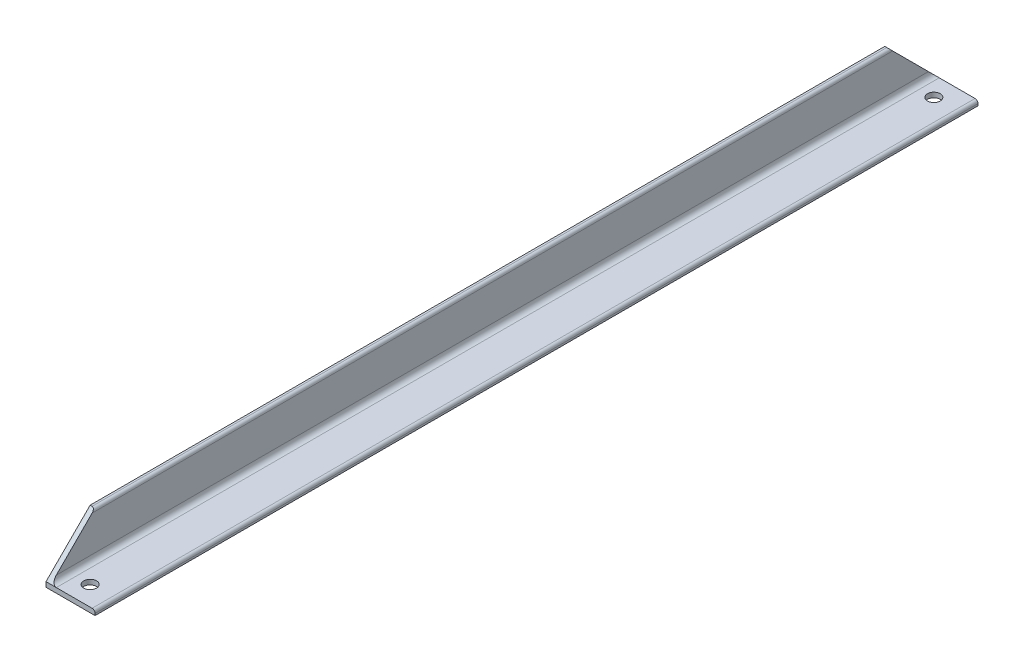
ISO-10303-21;
HEADER;
FILE_DESCRIPTION(('STEP AP214'),'2;1');
FILE_NAME('part.step','',(''),(''),'','','');
FILE_SCHEMA(('AUTOMOTIVE_DESIGN { 1 0 10303 214 1 1 1 1 }'));
ENDSEC;
DATA;
#1=APPLICATION_CONTEXT('core data for automotive mechanical design processes');
#2=APPLICATION_PROTOCOL_DEFINITION('international standard','automotive_design',2000,#1);
#3=PRODUCT_CONTEXT('',#1,'mechanical');
#4=PRODUCT('Part','Part','',(#3));
#5=PRODUCT_RELATED_PRODUCT_CATEGORY('part','',(#4));
#6=PRODUCT_DEFINITION_FORMATION('','',#4);
#7=PRODUCT_DEFINITION_CONTEXT('part definition',#1,'design');
#8=PRODUCT_DEFINITION('design','',#6,#7);
#9=PRODUCT_DEFINITION_SHAPE('','',#8);
#10=(LENGTH_UNIT() NAMED_UNIT(*) SI_UNIT(.MILLI.,.METRE.));
#11=(NAMED_UNIT(*) PLANE_ANGLE_UNIT() SI_UNIT($,.RADIAN.));
#12=(NAMED_UNIT(*) SI_UNIT($,.STERADIAN.) SOLID_ANGLE_UNIT());
#13=UNCERTAINTY_MEASURE_WITH_UNIT(LENGTH_MEASURE(1.E-05),#10,'distance_accuracy_value','');
#14=(GEOMETRIC_REPRESENTATION_CONTEXT(3) GLOBAL_UNCERTAINTY_ASSIGNED_CONTEXT((#13)) GLOBAL_UNIT_ASSIGNED_CONTEXT((#10,
#11,#12)) REPRESENTATION_CONTEXT('',''));
#15=CARTESIAN_POINT('',(0.,0.,0.));
#16=DIRECTION('',(0.,0.,1.));
#17=DIRECTION('',(1.,0.,0.));
#18=AXIS2_PLACEMENT_3D('',#15,#16,#17);
#19=CARTESIAN_POINT('',(1.99999999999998,50.,450.));
#20=DIRECTION('',(0.,-1.,0.));
#21=DIRECTION('',(0.,0.,-1.));
#22=AXIS2_PLACEMENT_3D('',#19,#20,#21);
#23=PLANE('',#22);
#24=DIRECTION('',(0.,0.,-1.));
#25=VECTOR('',#24,1.);
#26=CARTESIAN_POINT('',(1.99999999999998,50.,450.));
#27=LINE('',#26,#25);
#28=CARTESIAN_POINT('',(2.,50.,405.));
#29=VERTEX_POINT('',#28);
#30=CARTESIAN_POINT('',(2.,50.,-405.));
#31=VERTEX_POINT('',#30);
#32=EDGE_CURVE('E159',#29,#31,#27,.T.);
#33=ORIENTED_EDGE('',*,*,#32,.T.);
#34=DIRECTION('',(-1.,0.,0.));
#35=VECTOR('',#34,1.);
#36=CARTESIAN_POINT('',(920.,50.,-405.));
#37=LINE('',#36,#35);
#38=CARTESIAN_POINT('',(0.,50.,-405.));
#39=VERTEX_POINT('',#38);
#40=EDGE_CURVE('E136',#31,#39,#37,.T.);
#41=ORIENTED_EDGE('',*,*,#40,.T.);
#42=DIRECTION('',(0.,0.,-1.));
#43=VECTOR('',#42,1.);
#44=CARTESIAN_POINT('',(0.,50.,450.));
#45=LINE('',#44,#43);
#46=CARTESIAN_POINT('',(0.,50.,405.));
#47=VERTEX_POINT('',#46);
#48=EDGE_CURVE('E135',#47,#39,#45,.T.);
#49=ORIENTED_EDGE('',*,*,#48,.F.);
#50=DIRECTION('',(-1.,0.,0.));
#51=VECTOR('',#50,1.);
#52=CARTESIAN_POINT('',(920.,50.,405.));
#53=LINE('',#52,#51);
#54=EDGE_CURVE('E204',#29,#47,#53,.T.);
#55=ORIENTED_EDGE('',*,*,#54,.F.);
#56=EDGE_LOOP('',(#33,#41,#49,#55));
#57=FACE_BOUND('',#56,.T.);
#58=ADVANCED_FACE('F39',(#57),#23,.F.);
#59=CARTESIAN_POINT('',(0.,50.,450.));
#60=DIRECTION('',(1.,0.,0.));
#61=DIRECTION('',(0.,1.,0.));
#62=AXIS2_PLACEMENT_3D('',#59,#60,#61);
#63=PLANE('',#62);
#64=ORIENTED_EDGE('',*,*,#48,.T.);
#65=DIRECTION('',(0.,0.707106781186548,0.707106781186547));
#66=VECTOR('',#65,1.);
#67=CARTESIAN_POINT('',(0.,50.,-405.));
#68=LINE('',#67,#66);
#69=CARTESIAN_POINT('',(0.,5.,-450.));
#70=VERTEX_POINT('',#69);
#71=EDGE_CURVE('E123',#70,#39,#68,.T.);
#72=ORIENTED_EDGE('',*,*,#71,.F.);
#73=DIRECTION('',(0.,-1.,0.));
#74=VECTOR('',#73,1.);
#75=CARTESIAN_POINT('',(0.,50.,-450.));
#76=LINE('',#75,#74);
#77=CARTESIAN_POINT('',(0.,0.,-450.));
#78=VERTEX_POINT('',#77);
#79=EDGE_CURVE('E132',#70,#78,#76,.T.);
#80=ORIENTED_EDGE('',*,*,#79,.T.);
#81=DIRECTION('',(0.,0.,-1.));
#82=VECTOR('',#81,1.);
#83=CARTESIAN_POINT('',(0.,0.,450.));
#84=LINE('',#83,#82);
#85=CARTESIAN_POINT('',(0.,0.,450.));
#86=VERTEX_POINT('',#85);
#87=EDGE_CURVE('E180',#86,#78,#84,.T.);
#88=ORIENTED_EDGE('',*,*,#87,.F.);
#89=DIRECTION('',(0.,-1.,0.));
#90=VECTOR('',#89,1.);
#91=CARTESIAN_POINT('',(0.,50.,450.));
#92=LINE('',#91,#90);
#93=CARTESIAN_POINT('',(0.,5.,450.));
#94=VERTEX_POINT('',#93);
#95=EDGE_CURVE('E94',#94,#86,#92,.T.);
#96=ORIENTED_EDGE('',*,*,#95,.F.);
#97=DIRECTION('',(0.,-0.707106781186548,0.707106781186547));
#98=VECTOR('',#97,1.);
#99=CARTESIAN_POINT('',(0.,50.,405.));
#100=LINE('',#99,#98);
#101=EDGE_CURVE('E55',#47,#94,#100,.T.);
#102=ORIENTED_EDGE('',*,*,#101,.F.);
#103=EDGE_LOOP('',(#64,#72,#80,#88,#96,#102));
#104=FACE_BOUND('',#103,.T.);
#105=ADVANCED_FACE('F131',(#104),#63,.F.);
#106=CARTESIAN_POINT('',(0.,0.,450.));
#107=DIRECTION('',(0.,1.,0.));
#108=DIRECTION('',(0.,0.,1.));
#109=AXIS2_PLACEMENT_3D('',#106,#107,#108);
#110=PLANE('',#109);
#111=CARTESIAN_POINT('',(25.,0.,-430.));
#112=DIRECTION('',(0.,-1.,0.));
#113=DIRECTION('',(0.,0.,-1.));
#114=AXIS2_PLACEMENT_3D('',#111,#112,#113);
#115=CIRCLE('',#114,6.5);
#116=CARTESIAN_POINT('',(25.,0.,-436.5));
#117=VERTEX_POINT('',#116);
#118=EDGE_CURVE('E192',#117,#117,#115,.T.);
#119=ORIENTED_EDGE('',*,*,#118,.F.);
#120=EDGE_LOOP('',(#119));
#121=FACE_BOUND('',#120,.T.);
#122=CARTESIAN_POINT('',(25.,0.,430.));
#123=DIRECTION('',(0.,-1.,0.));
#124=DIRECTION('',(0.,0.,-1.));
#125=AXIS2_PLACEMENT_3D('',#122,#123,#124);
#126=CIRCLE('',#125,6.5);
#127=CARTESIAN_POINT('',(25.,0.,423.5));
#128=VERTEX_POINT('',#127);
#129=EDGE_CURVE('E184',#128,#128,#126,.T.);
#130=ORIENTED_EDGE('',*,*,#129,.F.);
#131=EDGE_LOOP('',(#130));
#132=FACE_BOUND('',#131,.T.);
#133=DIRECTION('',(1.,0.,0.));
#134=VECTOR('',#133,1.);
#135=CARTESIAN_POINT('',(0.,0.,-450.));
#136=LINE('',#135,#134);
#137=CARTESIAN_POINT('',(50.,0.,-450.));
#138=VERTEX_POINT('',#137);
#139=EDGE_CURVE('E142',#78,#138,#136,.T.);
#140=ORIENTED_EDGE('',*,*,#139,.T.);
#141=DIRECTION('',(0.,0.,-1.));
#142=VECTOR('',#141,1.);
#143=CARTESIAN_POINT('',(50.,0.,450.));
#144=LINE('',#143,#142);
#145=CARTESIAN_POINT('',(50.,0.,450.));
#146=VERTEX_POINT('',#145);
#147=EDGE_CURVE('E177',#146,#138,#144,.T.);
#148=ORIENTED_EDGE('',*,*,#147,.F.);
#149=DIRECTION('',(1.,0.,0.));
#150=VECTOR('',#149,1.);
#151=CARTESIAN_POINT('',(0.,0.,450.));
#152=LINE('',#151,#150);
#153=EDGE_CURVE('E212',#86,#146,#152,.T.);
#154=ORIENTED_EDGE('',*,*,#153,.F.);
#155=ORIENTED_EDGE('',*,*,#87,.T.);
#156=EDGE_LOOP('',(#140,#148,#154,#155));
#157=FACE_BOUND('',#156,.T.);
#158=ADVANCED_FACE('F237',(#121,#132,#157),#110,.F.);
#159=CARTESIAN_POINT('',(50.,0.,450.));
#160=DIRECTION('',(-1.,0.,0.));
#161=DIRECTION('',(0.,0.,1.));
#162=AXIS2_PLACEMENT_3D('',#159,#160,#161);
#163=PLANE('',#162);
#164=DIRECTION('',(0.,1.,0.));
#165=VECTOR('',#164,1.);
#166=CARTESIAN_POINT('',(50.,0.,-450.));
#167=LINE('',#166,#165);
#168=CARTESIAN_POINT('',(50.,1.99999999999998,-450.));
#169=VERTEX_POINT('',#168);
#170=EDGE_CURVE('E145',#138,#169,#167,.T.);
#171=ORIENTED_EDGE('',*,*,#170,.T.);
#172=DIRECTION('',(0.,0.,-1.));
#173=VECTOR('',#172,1.);
#174=CARTESIAN_POINT('',(50.,1.99999999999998,450.));
#175=LINE('',#174,#173);
#176=CARTESIAN_POINT('',(50.,1.99999999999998,450.));
#177=VERTEX_POINT('',#176);
#178=EDGE_CURVE('E174',#177,#169,#175,.T.);
#179=ORIENTED_EDGE('',*,*,#178,.F.);
#180=DIRECTION('',(0.,1.,0.));
#181=VECTOR('',#180,1.);
#182=CARTESIAN_POINT('',(50.,0.,450.));
#183=LINE('',#182,#181);
#184=EDGE_CURVE('E214',#146,#177,#183,.T.);
#185=ORIENTED_EDGE('',*,*,#184,.F.);
#186=ORIENTED_EDGE('',*,*,#147,.T.);
#187=EDGE_LOOP('',(#171,#179,#185,#186));
#188=FACE_BOUND('',#187,.T.);
#189=ADVANCED_FACE('F242',(#188),#163,.F.);
#190=CARTESIAN_POINT('',(47.,2.,450.));
#191=DIRECTION('',(0.,0.,-1.));
#192=DIRECTION('',(-1.,0.,0.));
#193=AXIS2_PLACEMENT_3D('',#190,#191,#192);
#194=CYLINDRICAL_SURFACE('',#193,3.);
#195=CARTESIAN_POINT('',(47.,2.,-450.));
#196=DIRECTION('',(0.,0.,1.));
#197=DIRECTION('',(1.,0.,0.));
#198=AXIS2_PLACEMENT_3D('',#195,#196,#197);
#199=CIRCLE('',#198,3.);
#200=CARTESIAN_POINT('',(47.,5.,-450.));
#201=VERTEX_POINT('',#200);
#202=EDGE_CURVE('E155',#169,#201,#199,.T.);
#203=ORIENTED_EDGE('',*,*,#202,.T.);
#204=DIRECTION('',(0.,0.,-1.));
#205=VECTOR('',#204,1.);
#206=CARTESIAN_POINT('',(47.,5.,450.));
#207=LINE('',#206,#205);
#208=CARTESIAN_POINT('',(47.,5.,450.));
#209=VERTEX_POINT('',#208);
#210=EDGE_CURVE('E171',#209,#201,#207,.T.);
#211=ORIENTED_EDGE('',*,*,#210,.F.);
#212=CARTESIAN_POINT('',(47.,2.,450.));
#213=DIRECTION('',(0.,0.,1.));
#214=DIRECTION('',(1.,0.,0.));
#215=AXIS2_PLACEMENT_3D('',#212,#213,#214);
#216=CIRCLE('',#215,3.);
#217=EDGE_CURVE('E64',#177,#209,#216,.T.);
#218=ORIENTED_EDGE('',*,*,#217,.F.);
#219=ORIENTED_EDGE('',*,*,#178,.T.);
#220=EDGE_LOOP('',(#203,#211,#218,#219));
#221=FACE_BOUND('',#220,.T.);
#222=ADVANCED_FACE('F248',(#221),#194,.T.);
#223=CARTESIAN_POINT('',(47.,5.,450.));
#224=DIRECTION('',(0.,-1.,0.));
#225=DIRECTION('',(1.,0.,0.));
#226=AXIS2_PLACEMENT_3D('',#223,#224,#225);
#227=PLANE('',#226);
#228=CARTESIAN_POINT('',(25.,5.,-430.));
#229=DIRECTION('',(0.,-1.,0.));
#230=DIRECTION('',(1.,0.,0.));
#231=AXIS2_PLACEMENT_3D('',#228,#229,#230);
#232=CIRCLE('',#231,6.5);
#233=CARTESIAN_POINT('',(31.5,5.00000000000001,-430.));
#234=VERTEX_POINT('',#233);
#235=EDGE_CURVE('E42',#234,#234,#232,.T.);
#236=ORIENTED_EDGE('',*,*,#235,.T.);
#237=EDGE_LOOP('',(#236));
#238=FACE_BOUND('',#237,.T.);
#239=CARTESIAN_POINT('',(25.,5.,430.));
#240=DIRECTION('',(0.,-1.,0.));
#241=DIRECTION('',(1.,0.,0.));
#242=AXIS2_PLACEMENT_3D('',#239,#240,#241);
#243=CIRCLE('',#242,6.5);
#244=CARTESIAN_POINT('',(31.5,5.00000000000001,430.));
#245=VERTEX_POINT('',#244);
#246=EDGE_CURVE('E137',#245,#245,#243,.T.);
#247=ORIENTED_EDGE('',*,*,#246,.T.);
#248=EDGE_LOOP('',(#247));
#249=FACE_BOUND('',#248,.T.);
#250=DIRECTION('',(-1.,0.,0.));
#251=VECTOR('',#250,1.);
#252=CARTESIAN_POINT('',(47.,5.,-450.));
#253=LINE('',#252,#251);
#254=CARTESIAN_POINT('',(10.5,5.,-450.));
#255=VERTEX_POINT('',#254);
#256=EDGE_CURVE('E157',#201,#255,#253,.T.);
#257=ORIENTED_EDGE('',*,*,#256,.T.);
#258=DIRECTION('',(0.,0.,-1.));
#259=VECTOR('',#258,1.);
#260=CARTESIAN_POINT('',(10.5,5.,450.));
#261=LINE('',#260,#259);
#262=CARTESIAN_POINT('',(10.5000000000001,5.,450.));
#263=VERTEX_POINT('',#262);
#264=EDGE_CURVE('E168',#263,#255,#261,.T.);
#265=ORIENTED_EDGE('',*,*,#264,.F.);
#266=DIRECTION('',(-1.,0.,0.));
#267=VECTOR('',#266,1.);
#268=CARTESIAN_POINT('',(47.,5.,450.));
#269=LINE('',#268,#267);
#270=EDGE_CURVE('E151',#209,#263,#269,.T.);
#271=ORIENTED_EDGE('',*,*,#270,.F.);
#272=ORIENTED_EDGE('',*,*,#210,.T.);
#273=EDGE_LOOP('',(#257,#265,#271,#272));
#274=FACE_BOUND('',#273,.T.);
#275=ADVANCED_FACE('F219',(#238,#249,#274),#227,.F.);
#276=CARTESIAN_POINT('',(10.5,10.5,450.));
#277=DIRECTION('',(0.,0.,-1.));
#278=DIRECTION('',(-1.,0.,0.));
#279=AXIS2_PLACEMENT_3D('',#276,#277,#278);
#280=CYLINDRICAL_SURFACE('',#279,5.5);
#281=ORIENTED_EDGE('',*,*,#264,.T.);
#282=CARTESIAN_POINT('',(10.5,10.5,-444.5));
#283=DIRECTION('',(0.,-0.707106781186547,0.707106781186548));
#284=DIRECTION('',(0.,-0.707106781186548,-0.707106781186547));
#285=AXIS2_PLACEMENT_3D('',#282,#283,#284);
#286=ELLIPSE('',#285,7.77817459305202,5.5);
#287=CARTESIAN_POINT('',(5.,10.5,-444.5));
#288=VERTEX_POINT('',#287);
#289=EDGE_CURVE('E89',#255,#288,#286,.F.);
#290=ORIENTED_EDGE('',*,*,#289,.T.);
#291=DIRECTION('',(0.,0.,-1.));
#292=VECTOR('',#291,1.);
#293=CARTESIAN_POINT('',(5.,10.5,450.));
#294=LINE('',#293,#292);
#295=CARTESIAN_POINT('',(5.,10.5,444.5));
#296=VERTEX_POINT('',#295);
#297=EDGE_CURVE('E165',#296,#288,#294,.T.);
#298=ORIENTED_EDGE('',*,*,#297,.F.);
#299=CARTESIAN_POINT('',(10.5,10.5,444.5));
#300=DIRECTION('',(0.,-0.707106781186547,-0.707106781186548));
#301=DIRECTION('',(0.,0.707106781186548,-0.707106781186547));
#302=AXIS2_PLACEMENT_3D('',#299,#300,#301);
#303=ELLIPSE('',#302,7.77817459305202,5.5);
#304=EDGE_CURVE('E143',#296,#263,#303,.F.);
#305=ORIENTED_EDGE('',*,*,#304,.T.);
#306=EDGE_LOOP('',(#281,#290,#298,#305));
#307=FACE_BOUND('',#306,.T.);
#308=ADVANCED_FACE('F221',(#307),#280,.F.);
#309=CARTESIAN_POINT('',(5.,10.5,450.));
#310=DIRECTION('',(-1.,0.,0.));
#311=DIRECTION('',(0.,0.,1.));
#312=AXIS2_PLACEMENT_3D('',#309,#310,#311);
#313=PLANE('',#312);
#314=ORIENTED_EDGE('',*,*,#297,.T.);
#315=DIRECTION('',(0.,0.707106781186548,0.707106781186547));
#316=VECTOR('',#315,1.);
#317=CARTESIAN_POINT('',(5.,457.75,2.74999999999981));
#318=LINE('',#317,#316);
#319=CARTESIAN_POINT('',(5.,47.,-408.));
#320=VERTEX_POINT('',#319);
#321=EDGE_CURVE('E199',#288,#320,#318,.T.);
#322=ORIENTED_EDGE('',*,*,#321,.T.);
#323=DIRECTION('',(0.,0.,-1.));
#324=VECTOR('',#323,1.);
#325=CARTESIAN_POINT('',(5.,47.,450.));
#326=LINE('',#325,#324);
#327=CARTESIAN_POINT('',(5.,47.,408.));
#328=VERTEX_POINT('',#327);
#329=EDGE_CURVE('E162',#328,#320,#326,.T.);
#330=ORIENTED_EDGE('',*,*,#329,.F.);
#331=DIRECTION('',(0.,-0.707106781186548,0.707106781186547));
#332=VECTOR('',#331,1.);
#333=CARTESIAN_POINT('',(5.,7.75000000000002,447.25));
#334=LINE('',#333,#332);
#335=EDGE_CURVE('E148',#328,#296,#334,.T.);
#336=ORIENTED_EDGE('',*,*,#335,.T.);
#337=EDGE_LOOP('',(#314,#322,#330,#336));
#338=FACE_BOUND('',#337,.T.);
#339=ADVANCED_FACE('F226',(#338),#313,.F.);
#340=CARTESIAN_POINT('',(2.,47.,450.));
#341=DIRECTION('',(0.,0.,-1.));
#342=DIRECTION('',(-1.,0.,0.));
#343=AXIS2_PLACEMENT_3D('',#340,#341,#342);
#344=CYLINDRICAL_SURFACE('',#343,3.);
#345=ORIENTED_EDGE('',*,*,#329,.T.);
#346=CARTESIAN_POINT('',(2.,47.,-408.));
#347=DIRECTION('',(0.,-0.707106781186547,0.707106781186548));
#348=DIRECTION('',(0.,-0.707106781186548,-0.707106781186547));
#349=AXIS2_PLACEMENT_3D('',#346,#347,#348);
#350=ELLIPSE('',#349,4.24264068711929,3.);
#351=EDGE_CURVE('E196',#320,#31,#350,.T.);
#352=ORIENTED_EDGE('',*,*,#351,.T.);
#353=ORIENTED_EDGE('',*,*,#32,.F.);
#354=CARTESIAN_POINT('',(2.,47.,408.));
#355=DIRECTION('',(0.,-0.707106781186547,-0.707106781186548));
#356=DIRECTION('',(0.,0.707106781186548,-0.707106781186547));
#357=AXIS2_PLACEMENT_3D('',#354,#355,#356);
#358=ELLIPSE('',#357,4.24264068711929,3.);
#359=EDGE_CURVE('E206',#29,#328,#358,.T.);
#360=ORIENTED_EDGE('',*,*,#359,.T.);
#361=EDGE_LOOP('',(#345,#352,#353,#360));
#362=FACE_BOUND('',#361,.T.);
#363=ADVANCED_FACE('F228',(#362),#344,.T.);
#364=CARTESIAN_POINT('',(47.,2.,450.));
#365=DIRECTION('',(0.,0.,1.));
#366=DIRECTION('',(1.,0.,0.));
#367=AXIS2_PLACEMENT_3D('',#364,#365,#366);
#368=PLANE('',#367);
#369=DIRECTION('',(1.,0.,0.));
#370=VECTOR('',#369,1.);
#371=CARTESIAN_POINT('',(47.,5.,450.));
#372=LINE('',#371,#370);
#373=EDGE_CURVE('E47',#94,#263,#372,.T.);
#374=ORIENTED_EDGE('',*,*,#373,.F.);
#375=ORIENTED_EDGE('',*,*,#95,.T.);
#376=ORIENTED_EDGE('',*,*,#153,.T.);
#377=ORIENTED_EDGE('',*,*,#184,.T.);
#378=ORIENTED_EDGE('',*,*,#217,.T.);
#379=ORIENTED_EDGE('',*,*,#270,.T.);
#380=EDGE_LOOP('',(#374,#375,#376,#377,#378,#379));
#381=FACE_BOUND('',#380,.T.);
#382=ADVANCED_FACE('F217',(#381),#368,.T.);
#383=CARTESIAN_POINT('',(47.,2.,-450.));
#384=DIRECTION('',(0.,0.,1.));
#385=DIRECTION('',(1.,0.,0.));
#386=AXIS2_PLACEMENT_3D('',#383,#384,#385);
#387=PLANE('',#386);
#388=ORIENTED_EDGE('',*,*,#79,.F.);
#389=DIRECTION('',(1.,0.,0.));
#390=VECTOR('',#389,1.);
#391=CARTESIAN_POINT('',(47.,5.,-450.));
#392=LINE('',#391,#390);
#393=EDGE_CURVE('E11',#70,#255,#392,.T.);
#394=ORIENTED_EDGE('',*,*,#393,.T.);
#395=ORIENTED_EDGE('',*,*,#256,.F.);
#396=ORIENTED_EDGE('',*,*,#202,.F.);
#397=ORIENTED_EDGE('',*,*,#170,.F.);
#398=ORIENTED_EDGE('',*,*,#139,.F.);
#399=EDGE_LOOP('',(#388,#394,#395,#396,#397,#398));
#400=FACE_BOUND('',#399,.T.);
#401=ADVANCED_FACE('F140',(#400),#387,.F.);
#402=CARTESIAN_POINT('',(920.,50.,405.));
#403=DIRECTION('',(0.,-0.707106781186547,-0.707106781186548));
#404=DIRECTION('',(0.,0.707106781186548,-0.707106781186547));
#405=AXIS2_PLACEMENT_3D('',#402,#403,#404);
#406=PLANE('',#405);
#407=ORIENTED_EDGE('',*,*,#335,.F.);
#408=ORIENTED_EDGE('',*,*,#359,.F.);
#409=ORIENTED_EDGE('',*,*,#54,.T.);
#410=ORIENTED_EDGE('',*,*,#101,.T.);
#411=ORIENTED_EDGE('',*,*,#373,.T.);
#412=ORIENTED_EDGE('',*,*,#304,.F.);
#413=EDGE_LOOP('',(#407,#408,#409,#410,#411,#412));
#414=FACE_BOUND('',#413,.T.);
#415=ADVANCED_FACE('F223',(#414),#406,.F.);
#416=CARTESIAN_POINT('',(920.,50.,-405.));
#417=DIRECTION('',(0.,-0.707106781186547,0.707106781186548));
#418=DIRECTION('',(0.,-0.707106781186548,-0.707106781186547));
#419=AXIS2_PLACEMENT_3D('',#416,#417,#418);
#420=PLANE('',#419);
#421=ORIENTED_EDGE('',*,*,#393,.F.);
#422=ORIENTED_EDGE('',*,*,#71,.T.);
#423=ORIENTED_EDGE('',*,*,#40,.F.);
#424=ORIENTED_EDGE('',*,*,#351,.F.);
#425=ORIENTED_EDGE('',*,*,#321,.F.);
#426=ORIENTED_EDGE('',*,*,#289,.F.);
#427=EDGE_LOOP('',(#421,#422,#423,#424,#425,#426));
#428=FACE_BOUND('',#427,.T.);
#429=ADVANCED_FACE('F122',(#428),#420,.F.);
#430=CARTESIAN_POINT('',(25.,920.,430.));
#431=DIRECTION('',(0.,-1.,0.));
#432=DIRECTION('',(0.,0.,-1.));
#433=AXIS2_PLACEMENT_3D('',#430,#431,#432);
#434=CYLINDRICAL_SURFACE('',#433,6.5);
#435=ORIENTED_EDGE('',*,*,#129,.T.);
#436=EDGE_LOOP('',(#435));
#437=FACE_BOUND('',#436,.T.);
#438=ORIENTED_EDGE('',*,*,#246,.F.);
#439=EDGE_LOOP('',(#438));
#440=FACE_BOUND('',#439,.T.);
#441=ADVANCED_FACE('F268',(#437,#440),#434,.F.);
#442=CARTESIAN_POINT('',(25.,920.,-430.));
#443=DIRECTION('',(0.,-1.,0.));
#444=DIRECTION('',(0.,0.,-1.));
#445=AXIS2_PLACEMENT_3D('',#442,#443,#444);
#446=CYLINDRICAL_SURFACE('',#445,6.5);
#447=ORIENTED_EDGE('',*,*,#118,.T.);
#448=EDGE_LOOP('',(#447));
#449=FACE_BOUND('',#448,.T.);
#450=ORIENTED_EDGE('',*,*,#235,.F.);
#451=EDGE_LOOP('',(#450));
#452=FACE_BOUND('',#451,.T.);
#453=ADVANCED_FACE('F271',(#449,#452),#446,.F.);
#454=CLOSED_SHELL('',(#58,#105,#158,#189,#222,#275,#308,#339,#363,#382,#401,#415,#429,#441,#453));
#455=MANIFOLD_SOLID_BREP('B2',#454);
#456=ADVANCED_BREP_SHAPE_REPRESENTATION('',(#18,#455),#14);
#457=SHAPE_DEFINITION_REPRESENTATION(#9,#456);
ENDSEC;
END-ISO-10303-21;
